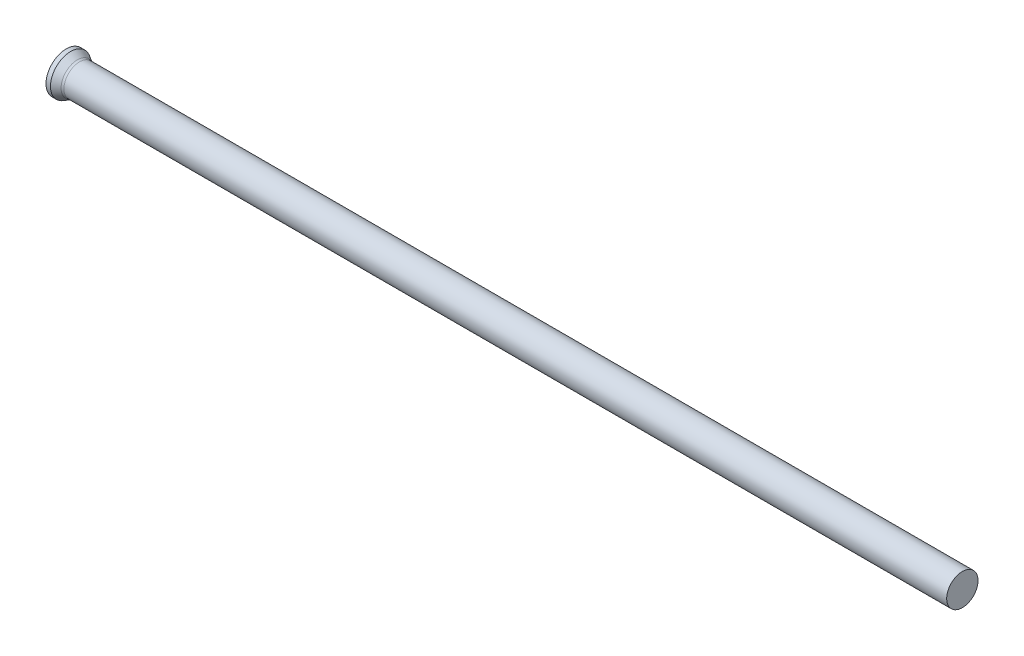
ISO-10303-21;
HEADER;
FILE_DESCRIPTION(('STEP AP214'),'2;1');
FILE_NAME('part.step','',(''),(''),'','','');
FILE_SCHEMA(('AUTOMOTIVE_DESIGN { 1 0 10303 214 1 1 1 1 }'));
ENDSEC;
DATA;
#1=APPLICATION_CONTEXT('core data for automotive mechanical design processes');
#2=APPLICATION_PROTOCOL_DEFINITION('international standard','automotive_design',2000,#1);
#3=PRODUCT_CONTEXT('',#1,'mechanical');
#4=PRODUCT('Part','Part','',(#3));
#5=PRODUCT_RELATED_PRODUCT_CATEGORY('part','',(#4));
#6=PRODUCT_DEFINITION_FORMATION('','',#4);
#7=PRODUCT_DEFINITION_CONTEXT('part definition',#1,'design');
#8=PRODUCT_DEFINITION('design','',#6,#7);
#9=PRODUCT_DEFINITION_SHAPE('','',#8);
#10=(LENGTH_UNIT() NAMED_UNIT(*) SI_UNIT(.MILLI.,.METRE.));
#11=(NAMED_UNIT(*) PLANE_ANGLE_UNIT() SI_UNIT($,.RADIAN.));
#12=(NAMED_UNIT(*) SI_UNIT($,.STERADIAN.) SOLID_ANGLE_UNIT());
#13=UNCERTAINTY_MEASURE_WITH_UNIT(LENGTH_MEASURE(1.E-05),#10,'distance_accuracy_value','');
#14=(GEOMETRIC_REPRESENTATION_CONTEXT(3) GLOBAL_UNCERTAINTY_ASSIGNED_CONTEXT((#13)) GLOBAL_UNIT_ASSIGNED_CONTEXT((#10,
#11,#12)) REPRESENTATION_CONTEXT('',''));
#15=CARTESIAN_POINT('',(0.,0.,0.));
#16=DIRECTION('',(0.,0.,1.));
#17=DIRECTION('',(1.,0.,0.));
#18=AXIS2_PLACEMENT_3D('',#15,#16,#17);
#19=CARTESIAN_POINT('',(0.,0.,0.));
#20=DIRECTION('',(1.,0.,0.));
#21=DIRECTION('',(0.,0.,-1.));
#22=AXIS2_PLACEMENT_3D('',#19,#20,#21);
#23=PLANE('',#22);
#24=CARTESIAN_POINT('',(0.,0.,0.));
#25=DIRECTION('',(-1.,0.,0.));
#26=DIRECTION('',(0.,0.,1.));
#27=AXIS2_PLACEMENT_3D('',#24,#25,#26);
#28=CIRCLE('',#27,4.5);
#29=CARTESIAN_POINT('',(0.,0.,4.5));
#30=VERTEX_POINT('',#29);
#31=EDGE_CURVE('E25',#30,#30,#28,.T.);
#32=ORIENTED_EDGE('',*,*,#31,.T.);
#33=EDGE_LOOP('',(#32));
#34=FACE_BOUND('',#33,.T.);
#35=ADVANCED_FACE('F14',(#34),#23,.F.);
#36=CARTESIAN_POINT('',(0.,0.,0.));
#37=DIRECTION('',(-1.,0.,0.));
#38=DIRECTION('',(0.,0.,1.));
#39=AXIS2_PLACEMENT_3D('',#36,#37,#38);
#40=CYLINDRICAL_SURFACE('',#39,4.5);
#41=ORIENTED_EDGE('',*,*,#31,.F.);
#42=EDGE_LOOP('',(#41));
#43=FACE_BOUND('',#42,.T.);
#44=CARTESIAN_POINT('',(0.997949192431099,0.,0.));
#45=DIRECTION('',(-1.,0.,0.));
#46=DIRECTION('',(0.,0.,1.));
#47=AXIS2_PLACEMENT_3D('',#44,#45,#46);
#48=CIRCLE('',#47,4.5);
#49=CARTESIAN_POINT('',(0.997949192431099,0.,4.5));
#50=VERTEX_POINT('',#49);
#51=EDGE_CURVE('E29',#50,#50,#48,.T.);
#52=ORIENTED_EDGE('',*,*,#51,.T.);
#53=EDGE_LOOP('',(#52));
#54=FACE_BOUND('',#53,.T.);
#55=ADVANCED_FACE('F53',(#43,#54),#40,.T.);
#56=CARTESIAN_POINT('',(2.73,0.,0.));
#57=DIRECTION('',(-1.,0.,0.));
#58=DIRECTION('',(0.,0.,1.));
#59=AXIS2_PLACEMENT_3D('',#56,#57,#58);
#60=CONICAL_SURFACE('',#59,3.5,0.523598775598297);
#61=CARTESIAN_POINT('',(2.49794919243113,0.,0.));
#62=DIRECTION('',(-1.,0.,0.));
#63=DIRECTION('',(0.,0.,1.));
#64=AXIS2_PLACEMENT_3D('',#61,#62,#63);
#65=CIRCLE('',#64,3.63397459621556);
#66=CARTESIAN_POINT('',(2.49794919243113,0.,3.63397459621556));
#67=VERTEX_POINT('',#66);
#68=EDGE_CURVE('E21',#67,#67,#65,.T.);
#69=ORIENTED_EDGE('',*,*,#68,.T.);
#70=EDGE_LOOP('',(#69));
#71=FACE_BOUND('',#70,.T.);
#72=ORIENTED_EDGE('',*,*,#51,.F.);
#73=EDGE_LOOP('',(#72));
#74=FACE_BOUND('',#73,.T.);
#75=ADVANCED_FACE('F50',(#71,#74),#60,.T.);
#76=CARTESIAN_POINT('',(0.,0.,0.));
#77=DIRECTION('',(-1.,0.,0.));
#78=DIRECTION('',(0.,0.,1.));
#79=AXIS2_PLACEMENT_3D('',#76,#77,#78);
#80=CYLINDRICAL_SURFACE('',#79,3.5);
#81=CARTESIAN_POINT('',(2.99794919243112,0.,0.));
#82=DIRECTION('',(-1.,0.,0.));
#83=DIRECTION('',(0.,0.,1.));
#84=AXIS2_PLACEMENT_3D('',#81,#82,#83);
#85=CIRCLE('',#84,3.5);
#86=CARTESIAN_POINT('',(2.99794919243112,0.,3.5));
#87=VERTEX_POINT('',#86);
#88=EDGE_CURVE('E9',#87,#87,#85,.F.);
#89=ORIENTED_EDGE('',*,*,#88,.T.);
#90=EDGE_LOOP('',(#89));
#91=FACE_BOUND('',#90,.T.);
#92=CARTESIAN_POINT('',(200.,0.,0.));
#93=DIRECTION('',(-1.,0.,0.));
#94=DIRECTION('',(0.,0.,1.));
#95=AXIS2_PLACEMENT_3D('',#92,#93,#94);
#96=CIRCLE('',#95,3.5);
#97=CARTESIAN_POINT('',(200.,0.,3.5));
#98=VERTEX_POINT('',#97);
#99=EDGE_CURVE('E34',#98,#98,#96,.T.);
#100=ORIENTED_EDGE('',*,*,#99,.T.);
#101=EDGE_LOOP('',(#100));
#102=FACE_BOUND('',#101,.T.);
#103=ADVANCED_FACE('F38',(#91,#102),#80,.T.);
#104=CARTESIAN_POINT('',(200.,3.5,0.));
#105=DIRECTION('',(-1.,0.,0.));
#106=DIRECTION('',(0.,0.,1.));
#107=AXIS2_PLACEMENT_3D('',#104,#105,#106);
#108=PLANE('',#107);
#109=ORIENTED_EDGE('',*,*,#99,.F.);
#110=EDGE_LOOP('',(#109));
#111=FACE_BOUND('',#110,.T.);
#112=ADVANCED_FACE('F40',(#111),#108,.F.);
#113=CARTESIAN_POINT('',(2.99794919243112,0.,0.));
#114=DIRECTION('',(-1.,0.,0.));
#115=DIRECTION('',(0.,0.,1.));
#116=AXIS2_PLACEMENT_3D('',#113,#114,#115);
#117=TOROIDAL_SURFACE('',#116,4.5,1.);
#118=ORIENTED_EDGE('',*,*,#88,.F.);
#119=EDGE_LOOP('',(#118));
#120=FACE_BOUND('',#119,.T.);
#121=ORIENTED_EDGE('',*,*,#68,.F.);
#122=EDGE_LOOP('',(#121));
#123=FACE_BOUND('',#122,.T.);
#124=ADVANCED_FACE('F16',(#120,#123),#117,.F.);
#125=CLOSED_SHELL('',(#35,#55,#75,#103,#112,#124));
#126=MANIFOLD_SOLID_BREP('B1',#125);
#127=ADVANCED_BREP_SHAPE_REPRESENTATION('',(#18,#126),#14);
#128=SHAPE_DEFINITION_REPRESENTATION(#9,#127);
ENDSEC;
END-ISO-10303-21;
